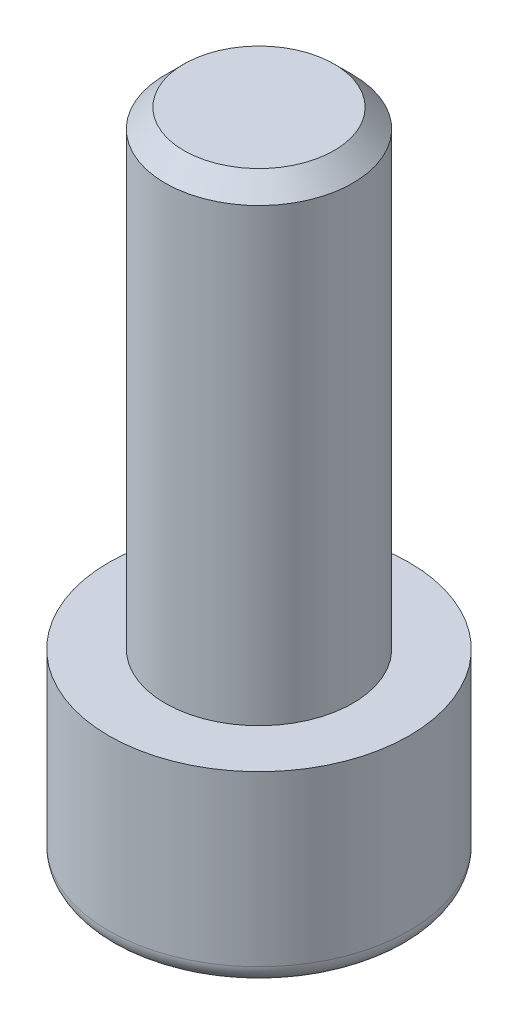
from build123d import *

# Parameters (mm, degrees)
ESQUISSE1_R             = 5
EXTRUSION1_DEPTH        = 25
CHANFREIN1_SIZE         = 1
ESQUISSE2_R             = 8
EXTRUSION2_DEPTH        = 10
CONG_1_R                = 1
ENL_V_MAT_EXTRU_1_DEPTH = 6


with BuildPart() as part:
    # Esquisse1 → Extrusion1 (new body)
    with BuildSketch(Plane(origin=(0, 0, 0), x_dir=(1, 0, 0), z_dir=(0, 1, 0))):
        with Locations(Location((0, 0, 0), (0, 0, 270))):
            Circle(ESQUISSE1_R)
    extrude(amount=EXTRUSION1_DEPTH)

    # Chanfrein1
    chanfrein1_edges = [part.edges().sort_by_distance(p)[0] for p in [
        (0, 25, -5),
    ]]
    chamfer(chanfrein1_edges, length=CHANFREIN1_SIZE)

    # Esquisse2 → Extrusion2 (add)
    with BuildSketch(Plane.XZ):
        with Locations(Location((0, 0, 0), (0, 0, 270))):
            Circle(ESQUISSE2_R)
    extrude(amount=EXTRUSION2_DEPTH)

    # Cong_1
    cong_1_edges = [part.edges().sort_by_distance(p)[0] for p in [
        (0, -10, 8),
    ]]
    fillet(cong_1_edges, radius=CONG_1_R)

    # Esquisse3 → Enl_v. mat.-Extru.1 (cut)
    with BuildSketch(Plane.XZ.offset(10)):
        Polygon((-4, 2.305648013), (0, 4.6), (4, 2.305648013), (4, -2.305648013), (0, -4.6), (-4, -2.305648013), align=None)
    extrude(amount=-ENL_V_MAT_EXTRU_1_DEPTH, mode=Mode.SUBTRACT)


solid = part.part
